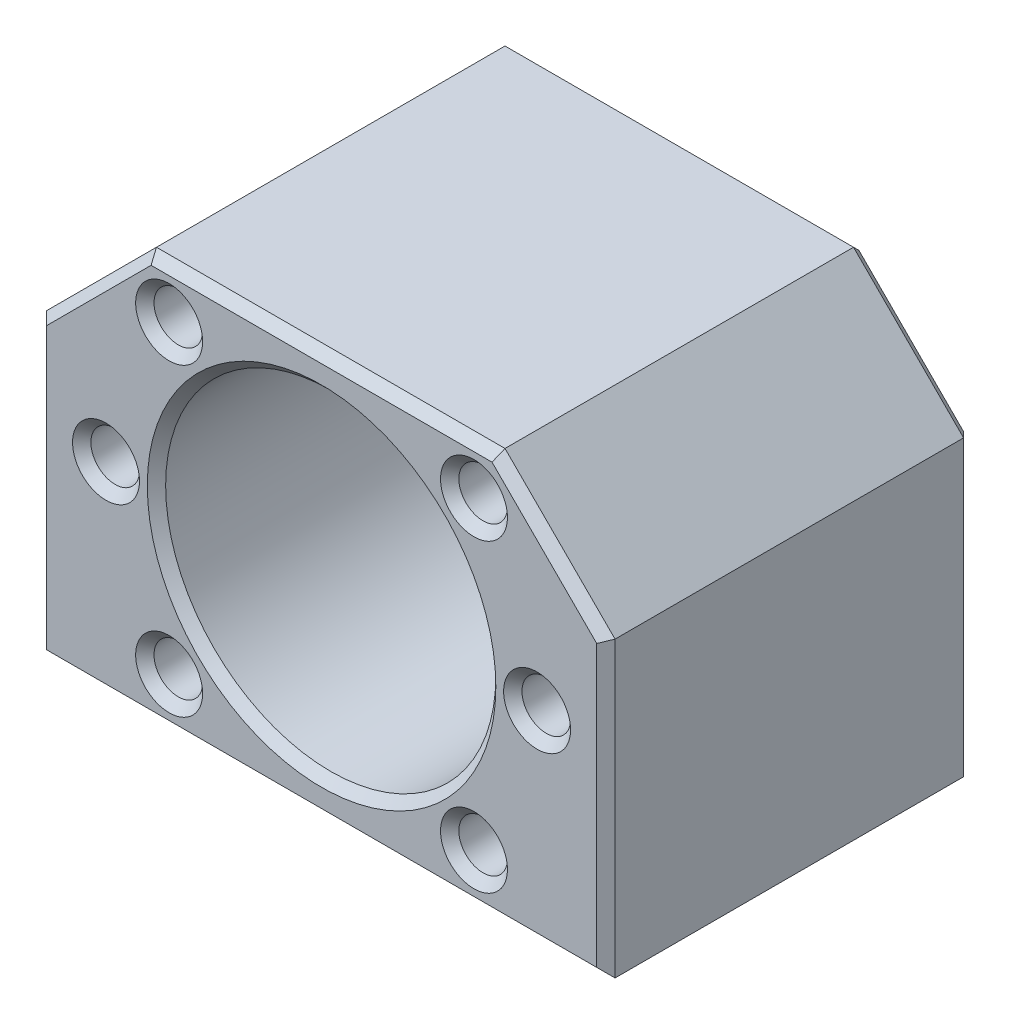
ISO-10303-21;
HEADER;
FILE_DESCRIPTION(('STEP AP214'),'2;1');
FILE_NAME('part.step','',(''),(''),'','','');
FILE_SCHEMA(('AUTOMOTIVE_DESIGN { 1 0 10303 214 1 1 1 1 }'));
ENDSEC;
DATA;
#1=APPLICATION_CONTEXT('core data for automotive mechanical design processes');
#2=APPLICATION_PROTOCOL_DEFINITION('international standard','automotive_design',2000,#1);
#3=PRODUCT_CONTEXT('',#1,'mechanical');
#4=PRODUCT('Part','Part','',(#3));
#5=PRODUCT_RELATED_PRODUCT_CATEGORY('part','',(#4));
#6=PRODUCT_DEFINITION_FORMATION('','',#4);
#7=PRODUCT_DEFINITION_CONTEXT('part definition',#1,'design');
#8=PRODUCT_DEFINITION('design','',#6,#7);
#9=PRODUCT_DEFINITION_SHAPE('','',#8);
#10=(LENGTH_UNIT() NAMED_UNIT(*) SI_UNIT(.MILLI.,.METRE.));
#11=(NAMED_UNIT(*) PLANE_ANGLE_UNIT() SI_UNIT($,.RADIAN.));
#12=(NAMED_UNIT(*) SI_UNIT($,.STERADIAN.) SOLID_ANGLE_UNIT());
#13=UNCERTAINTY_MEASURE_WITH_UNIT(LENGTH_MEASURE(1.E-05),#10,'distance_accuracy_value','');
#14=(GEOMETRIC_REPRESENTATION_CONTEXT(3) GLOBAL_UNCERTAINTY_ASSIGNED_CONTEXT((#13)) GLOBAL_UNIT_ASSIGNED_CONTEXT((#10,
#11,#12)) REPRESENTATION_CONTEXT('',''));
#15=CARTESIAN_POINT('',(0.,0.,0.));
#16=DIRECTION('',(0.,0.,1.));
#17=DIRECTION('',(1.,0.,0.));
#18=AXIS2_PLACEMENT_3D('',#15,#16,#17);
#19=CARTESIAN_POINT('',(0.,0.,20.));
#20=DIRECTION('',(0.,0.,1.));
#21=DIRECTION('',(1.,0.,0.));
#22=AXIS2_PLACEMENT_3D('',#19,#20,#21);
#23=PLANE('',#22);
#24=CARTESIAN_POINT('',(0.,0.,20.));
#25=DIRECTION('',(0.,0.,1.));
#26=DIRECTION('',(1.,0.,0.));
#27=AXIS2_PLACEMENT_3D('',#24,#25,#26);
#28=CIRCLE('',#27,19.);
#29=CARTESIAN_POINT('',(19.,0.,20.));
#30=VERTEX_POINT('',#29);
#31=EDGE_CURVE('E295',#30,#30,#28,.F.);
#32=ORIENTED_EDGE('',*,*,#31,.T.);
#33=EDGE_LOOP('',(#32));
#34=FACE_BOUND('',#33,.T.);
#35=DIRECTION('',(-0.707106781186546,-0.707106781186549,0.));
#36=VECTOR('',#35,1.);
#37=CARTESIAN_POINT('',(-19.7928932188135,19.7928932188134,20.));
#38=LINE('',#37,#36);
#39=CARTESIAN_POINT('',(-18.585786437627,21.,20.));
#40=VERTEX_POINT('',#39);
#41=CARTESIAN_POINT('',(-30.,9.58578643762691,20.));
#42=VERTEX_POINT('',#41);
#43=EDGE_CURVE('E81',#40,#42,#38,.T.);
#44=ORIENTED_EDGE('',*,*,#43,.T.);
#45=DIRECTION('',(0.,-1.,0.));
#46=VECTOR('',#45,1.);
#47=CARTESIAN_POINT('',(-30.,0.,20.));
#48=LINE('',#47,#46);
#49=CARTESIAN_POINT('',(-30.,-21.,20.));
#50=VERTEX_POINT('',#49);
#51=EDGE_CURVE('E292',#42,#50,#48,.T.);
#52=ORIENTED_EDGE('',*,*,#51,.T.);
#53=DIRECTION('',(1.,0.,0.));
#54=VECTOR('',#53,1.);
#55=CARTESIAN_POINT('',(31.,-21.,20.));
#56=LINE('',#55,#54);
#57=CARTESIAN_POINT('',(30.,-21.,20.));
#58=VERTEX_POINT('',#57);
#59=EDGE_CURVE('E279',#50,#58,#56,.T.);
#60=ORIENTED_EDGE('',*,*,#59,.T.);
#61=DIRECTION('',(0.,1.,0.));
#62=VECTOR('',#61,1.);
#63=CARTESIAN_POINT('',(30.,10.,20.));
#64=LINE('',#63,#62);
#65=CARTESIAN_POINT('',(30.,9.58578643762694,20.));
#66=VERTEX_POINT('',#65);
#67=EDGE_CURVE('E282',#58,#66,#64,.T.);
#68=ORIENTED_EDGE('',*,*,#67,.T.);
#69=DIRECTION('',(-0.707106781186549,0.707106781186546,0.));
#70=VECTOR('',#69,1.);
#71=CARTESIAN_POINT('',(19.7928932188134,19.7928932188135,20.));
#72=LINE('',#71,#70);
#73=CARTESIAN_POINT('',(18.5857864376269,21.,20.));
#74=VERTEX_POINT('',#73);
#75=EDGE_CURVE('E285',#66,#74,#72,.T.);
#76=ORIENTED_EDGE('',*,*,#75,.T.);
#77=DIRECTION('',(-1.,0.,0.));
#78=VECTOR('',#77,1.);
#79=CARTESIAN_POINT('',(0.,21.,20.));
#80=LINE('',#79,#78);
#81=EDGE_CURVE('E86',#74,#40,#80,.T.);
#82=ORIENTED_EDGE('',*,*,#81,.T.);
#83=EDGE_LOOP('',(#44,#52,#60,#68,#76,#82));
#84=FACE_BOUND('',#83,.T.);
#85=CARTESIAN_POINT('',(-16.6170093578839,16.6170093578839,20.));
#86=DIRECTION('',(0.,0.,1.));
#87=DIRECTION('',(1.,0.,0.));
#88=AXIS2_PLACEMENT_3D('',#85,#86,#87);
#89=CIRCLE('',#88,3.65000000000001);
#90=CARTESIAN_POINT('',(-12.9670093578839,16.6170093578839,20.));
#91=VERTEX_POINT('',#90);
#92=EDGE_CURVE('E275',#91,#91,#89,.F.);
#93=ORIENTED_EDGE('',*,*,#92,.T.);
#94=EDGE_LOOP('',(#93));
#95=FACE_BOUND('',#94,.T.);
#96=CARTESIAN_POINT('',(16.6170093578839,16.6170093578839,20.));
#97=DIRECTION('',(0.,0.,1.));
#98=DIRECTION('',(1.,0.,0.));
#99=AXIS2_PLACEMENT_3D('',#96,#97,#98);
#100=CIRCLE('',#99,3.65000000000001);
#101=CARTESIAN_POINT('',(20.2670093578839,16.6170093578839,20.));
#102=VERTEX_POINT('',#101);
#103=EDGE_CURVE('E271',#102,#102,#100,.F.);
#104=ORIENTED_EDGE('',*,*,#103,.T.);
#105=EDGE_LOOP('',(#104));
#106=FACE_BOUND('',#105,.T.);
#107=CARTESIAN_POINT('',(23.5,0.,20.));
#108=DIRECTION('',(0.,0.,1.));
#109=DIRECTION('',(1.,0.,0.));
#110=AXIS2_PLACEMENT_3D('',#107,#108,#109);
#111=CIRCLE('',#110,3.65000000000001);
#112=CARTESIAN_POINT('',(27.15,0.,20.));
#113=VERTEX_POINT('',#112);
#114=EDGE_CURVE('E267',#113,#113,#111,.F.);
#115=ORIENTED_EDGE('',*,*,#114,.T.);
#116=EDGE_LOOP('',(#115));
#117=FACE_BOUND('',#116,.T.);
#118=CARTESIAN_POINT('',(16.6170093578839,-16.6170093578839,20.));
#119=DIRECTION('',(0.,0.,1.));
#120=DIRECTION('',(1.,0.,0.));
#121=AXIS2_PLACEMENT_3D('',#118,#119,#120);
#122=CIRCLE('',#121,3.65);
#123=CARTESIAN_POINT('',(20.2670093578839,-16.6170093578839,20.));
#124=VERTEX_POINT('',#123);
#125=EDGE_CURVE('E263',#124,#124,#122,.F.);
#126=ORIENTED_EDGE('',*,*,#125,.T.);
#127=EDGE_LOOP('',(#126));
#128=FACE_BOUND('',#127,.T.);
#129=CARTESIAN_POINT('',(-16.6170093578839,-16.6170093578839,20.));
#130=DIRECTION('',(0.,0.,1.));
#131=DIRECTION('',(1.,0.,0.));
#132=AXIS2_PLACEMENT_3D('',#129,#130,#131);
#133=CIRCLE('',#132,3.65000000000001);
#134=CARTESIAN_POINT('',(-12.9670093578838,-16.6170093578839,20.));
#135=VERTEX_POINT('',#134);
#136=EDGE_CURVE('E259',#135,#135,#133,.F.);
#137=ORIENTED_EDGE('',*,*,#136,.T.);
#138=EDGE_LOOP('',(#137));
#139=FACE_BOUND('',#138,.T.);
#140=CARTESIAN_POINT('',(-23.5,0.,20.));
#141=DIRECTION('',(0.,0.,1.));
#142=DIRECTION('',(1.,0.,0.));
#143=AXIS2_PLACEMENT_3D('',#140,#141,#142);
#144=CIRCLE('',#143,3.65000000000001);
#145=CARTESIAN_POINT('',(-19.85,0.,20.));
#146=VERTEX_POINT('',#145);
#147=EDGE_CURVE('E255',#146,#146,#144,.F.);
#148=ORIENTED_EDGE('',*,*,#147,.T.);
#149=EDGE_LOOP('',(#148));
#150=FACE_BOUND('',#149,.T.);
#151=ADVANCED_FACE('F62',(#34,#84,#95,#106,#117,#128,#139,#150),#23,.T.);
#152=CARTESIAN_POINT('',(0.,0.,-20.));
#153=DIRECTION('',(0.,0.,1.));
#154=DIRECTION('',(1.,0.,0.));
#155=AXIS2_PLACEMENT_3D('',#152,#153,#154);
#156=PLANE('',#155);
#157=CARTESIAN_POINT('',(0.,0.,-20.));
#158=DIRECTION('',(0.,0.,1.));
#159=DIRECTION('',(1.,0.,0.));
#160=AXIS2_PLACEMENT_3D('',#157,#158,#159);
#161=CIRCLE('',#160,19.);
#162=CARTESIAN_POINT('',(19.,0.,-20.));
#163=VERTEX_POINT('',#162);
#164=EDGE_CURVE('E185',#163,#163,#161,.T.);
#165=ORIENTED_EDGE('',*,*,#164,.T.);
#166=EDGE_LOOP('',(#165));
#167=FACE_BOUND('',#166,.T.);
#168=DIRECTION('',(0.707106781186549,-0.707106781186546,0.));
#169=VECTOR('',#168,1.);
#170=CARTESIAN_POINT('',(30.2928932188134,9.29289321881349,-20.));
#171=LINE('',#170,#169);
#172=CARTESIAN_POINT('',(18.5857864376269,21.,-20.));
#173=VERTEX_POINT('',#172);
#174=CARTESIAN_POINT('',(30.,9.58578643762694,-20.));
#175=VERTEX_POINT('',#174);
#176=EDGE_CURVE('E183',#173,#175,#171,.T.);
#177=ORIENTED_EDGE('',*,*,#176,.T.);
#178=DIRECTION('',(0.,-1.,0.));
#179=VECTOR('',#178,1.);
#180=CARTESIAN_POINT('',(30.,0.,-20.));
#181=LINE('',#180,#179);
#182=CARTESIAN_POINT('',(30.,-21.,-20.));
#183=VERTEX_POINT('',#182);
#184=EDGE_CURVE('E160',#175,#183,#181,.T.);
#185=ORIENTED_EDGE('',*,*,#184,.T.);
#186=DIRECTION('',(-1.,0.,0.));
#187=VECTOR('',#186,1.);
#188=CARTESIAN_POINT('',(0.,-21.,-20.));
#189=LINE('',#188,#187);
#190=CARTESIAN_POINT('',(-30.,-21.,-20.));
#191=VERTEX_POINT('',#190);
#192=EDGE_CURVE('E171',#183,#191,#189,.T.);
#193=ORIENTED_EDGE('',*,*,#192,.T.);
#194=DIRECTION('',(0.,1.,0.));
#195=VECTOR('',#194,1.);
#196=CARTESIAN_POINT('',(-30.,10.,-20.));
#197=LINE('',#196,#195);
#198=CARTESIAN_POINT('',(-30.,9.58578643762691,-20.));
#199=VERTEX_POINT('',#198);
#200=EDGE_CURVE('E178',#191,#199,#197,.T.);
#201=ORIENTED_EDGE('',*,*,#200,.T.);
#202=DIRECTION('',(0.707106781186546,0.707106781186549,0.));
#203=VECTOR('',#202,1.);
#204=CARTESIAN_POINT('',(-18.2928932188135,21.2928932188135,-20.));
#205=LINE('',#204,#203);
#206=CARTESIAN_POINT('',(-18.5857864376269,21.,-20.));
#207=VERTEX_POINT('',#206);
#208=EDGE_CURVE('E430',#199,#207,#205,.T.);
#209=ORIENTED_EDGE('',*,*,#208,.T.);
#210=DIRECTION('',(1.,0.,0.));
#211=VECTOR('',#210,1.);
#212=CARTESIAN_POINT('',(19.,21.,-20.));
#213=LINE('',#212,#211);
#214=EDGE_CURVE('E192',#207,#173,#213,.T.);
#215=ORIENTED_EDGE('',*,*,#214,.T.);
#216=EDGE_LOOP('',(#177,#185,#193,#201,#209,#215));
#217=FACE_BOUND('',#216,.T.);
#218=ADVANCED_FACE('F181',(#167,#217),#156,.F.);
#219=CARTESIAN_POINT('',(-31.,-22.,20.));
#220=DIRECTION('',(0.,1.,0.));
#221=DIRECTION('',(0.,0.,1.));
#222=AXIS2_PLACEMENT_3D('',#219,#220,#221);
#223=PLANE('',#222);
#224=CARTESIAN_POINT('',(24.,-22.,12.));
#225=DIRECTION('',(0.,1.,0.));
#226=DIRECTION('',(0.,0.,1.));
#227=AXIS2_PLACEMENT_3D('',#224,#225,#226);
#228=CIRCLE('',#227,3.64999999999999);
#229=CARTESIAN_POINT('',(24.,-22.,15.65));
#230=VERTEX_POINT('',#229);
#231=EDGE_CURVE('E245',#230,#230,#228,.T.);
#232=ORIENTED_EDGE('',*,*,#231,.T.);
#233=EDGE_LOOP('',(#232));
#234=FACE_BOUND('',#233,.T.);
#235=CARTESIAN_POINT('',(24.,-22.,-12.));
#236=DIRECTION('',(0.,1.,0.));
#237=DIRECTION('',(0.,0.,1.));
#238=AXIS2_PLACEMENT_3D('',#235,#236,#237);
#239=CIRCLE('',#238,3.64999999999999);
#240=CARTESIAN_POINT('',(24.,-22.,-8.35000000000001));
#241=VERTEX_POINT('',#240);
#242=EDGE_CURVE('E241',#241,#241,#239,.T.);
#243=ORIENTED_EDGE('',*,*,#242,.T.);
#244=EDGE_LOOP('',(#243));
#245=FACE_BOUND('',#244,.T.);
#246=CARTESIAN_POINT('',(-24.,-22.,-12.));
#247=DIRECTION('',(0.,1.,0.));
#248=DIRECTION('',(0.,0.,1.));
#249=AXIS2_PLACEMENT_3D('',#246,#247,#248);
#250=CIRCLE('',#249,3.65000000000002);
#251=CARTESIAN_POINT('',(-24.,-22.,-8.34999999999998));
#252=VERTEX_POINT('',#251);
#253=EDGE_CURVE('E237',#252,#252,#250,.T.);
#254=ORIENTED_EDGE('',*,*,#253,.T.);
#255=EDGE_LOOP('',(#254));
#256=FACE_BOUND('',#255,.T.);
#257=CARTESIAN_POINT('',(-24.,-22.,12.));
#258=DIRECTION('',(0.,1.,0.));
#259=DIRECTION('',(0.,0.,1.));
#260=AXIS2_PLACEMENT_3D('',#257,#258,#259);
#261=CIRCLE('',#260,3.65000000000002);
#262=CARTESIAN_POINT('',(-24.,-22.,15.65));
#263=VERTEX_POINT('',#262);
#264=EDGE_CURVE('E233',#263,#263,#261,.T.);
#265=ORIENTED_EDGE('',*,*,#264,.T.);
#266=EDGE_LOOP('',(#265));
#267=FACE_BOUND('',#266,.T.);
#268=DIRECTION('',(0.,0.,-1.));
#269=VECTOR('',#268,1.);
#270=CARTESIAN_POINT('',(-31.,-22.,20.));
#271=LINE('',#270,#269);
#272=CARTESIAN_POINT('',(-31.,-22.,19.));
#273=VERTEX_POINT('',#272);
#274=CARTESIAN_POINT('',(-31.,-22.,-19.));
#275=VERTEX_POINT('',#274);
#276=EDGE_CURVE('E393',#273,#275,#271,.T.);
#277=ORIENTED_EDGE('',*,*,#276,.T.);
#278=DIRECTION('',(1.,0.,0.));
#279=VECTOR('',#278,1.);
#280=CARTESIAN_POINT('',(-31.,-22.,-19.));
#281=LINE('',#280,#279);
#282=CARTESIAN_POINT('',(31.,-22.,-19.));
#283=VERTEX_POINT('',#282);
#284=EDGE_CURVE('E252',#275,#283,#281,.T.);
#285=ORIENTED_EDGE('',*,*,#284,.T.);
#286=DIRECTION('',(0.,0.,-1.));
#287=VECTOR('',#286,1.);
#288=CARTESIAN_POINT('',(31.,-22.,20.));
#289=LINE('',#288,#287);
#290=CARTESIAN_POINT('',(31.,-22.,19.));
#291=VERTEX_POINT('',#290);
#292=EDGE_CURVE('E179',#291,#283,#289,.T.);
#293=ORIENTED_EDGE('',*,*,#292,.F.);
#294=DIRECTION('',(-1.,0.,0.));
#295=VECTOR('',#294,1.);
#296=CARTESIAN_POINT('',(-31.,-22.,19.));
#297=LINE('',#296,#295);
#298=EDGE_CURVE('E249',#291,#273,#297,.T.);
#299=ORIENTED_EDGE('',*,*,#298,.T.);
#300=EDGE_LOOP('',(#277,#285,#293,#299));
#301=FACE_BOUND('',#300,.T.);
#302=ADVANCED_FACE('F392',(#234,#245,#256,#267,#301),#223,.F.);
#303=CARTESIAN_POINT('',(31.,-22.,20.));
#304=DIRECTION('',(-1.,0.,0.));
#305=DIRECTION('',(0.,0.,1.));
#306=AXIS2_PLACEMENT_3D('',#303,#304,#305);
#307=PLANE('',#306);
#308=ORIENTED_EDGE('',*,*,#292,.T.);
#309=DIRECTION('',(0.,1.,0.));
#310=VECTOR('',#309,1.);
#311=CARTESIAN_POINT('',(31.,-22.,-19.));
#312=LINE('',#311,#310);
#313=CARTESIAN_POINT('',(31.,10.,-19.));
#314=VERTEX_POINT('',#313);
#315=EDGE_CURVE('E163',#283,#314,#312,.T.);
#316=ORIENTED_EDGE('',*,*,#315,.T.);
#317=DIRECTION('',(0.,0.,-1.));
#318=VECTOR('',#317,1.);
#319=CARTESIAN_POINT('',(31.,10.,20.));
#320=LINE('',#319,#318);
#321=CARTESIAN_POINT('',(31.,10.,19.));
#322=VERTEX_POINT('',#321);
#323=EDGE_CURVE('E422',#322,#314,#320,.T.);
#324=ORIENTED_EDGE('',*,*,#323,.F.);
#325=DIRECTION('',(0.,-1.,0.));
#326=VECTOR('',#325,1.);
#327=CARTESIAN_POINT('',(31.,-22.,19.));
#328=LINE('',#327,#326);
#329=EDGE_CURVE('E203',#322,#291,#328,.T.);
#330=ORIENTED_EDGE('',*,*,#329,.T.);
#331=EDGE_LOOP('',(#308,#316,#324,#330));
#332=FACE_BOUND('',#331,.T.);
#333=ADVANCED_FACE('F447',(#332),#307,.F.);
#334=CARTESIAN_POINT('',(19.,22.,20.));
#335=DIRECTION('',(0.707106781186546,0.707106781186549,0.));
#336=DIRECTION('',(-0.707106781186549,0.707106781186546,0.));
#337=AXIS2_PLACEMENT_3D('',#334,#335,#336);
#338=PLANE('',#337);
#339=ORIENTED_EDGE('',*,*,#323,.T.);
#340=DIRECTION('',(-0.707106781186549,0.707106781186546,0.));
#341=VECTOR('',#340,1.);
#342=CARTESIAN_POINT('',(19.,22.,-19.));
#343=LINE('',#342,#341);
#344=CARTESIAN_POINT('',(19.,22.,-19.));
#345=VERTEX_POINT('',#344);
#346=EDGE_CURVE('E211',#314,#345,#343,.T.);
#347=ORIENTED_EDGE('',*,*,#346,.T.);
#348=DIRECTION('',(0.,0.,-1.));
#349=VECTOR('',#348,1.);
#350=CARTESIAN_POINT('',(19.,22.,20.));
#351=LINE('',#350,#349);
#352=CARTESIAN_POINT('',(19.,22.,19.));
#353=VERTEX_POINT('',#352);
#354=EDGE_CURVE('E418',#353,#345,#351,.T.);
#355=ORIENTED_EDGE('',*,*,#354,.F.);
#356=DIRECTION('',(0.707106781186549,-0.707106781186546,0.));
#357=VECTOR('',#356,1.);
#358=CARTESIAN_POINT('',(19.,22.,19.));
#359=LINE('',#358,#357);
#360=EDGE_CURVE('E208',#353,#322,#359,.T.);
#361=ORIENTED_EDGE('',*,*,#360,.T.);
#362=EDGE_LOOP('',(#339,#347,#355,#361));
#363=FACE_BOUND('',#362,.T.);
#364=ADVANCED_FACE('F448',(#363),#338,.T.);
#365=CARTESIAN_POINT('',(-19.,22.,20.));
#366=DIRECTION('',(0.,1.,0.));
#367=DIRECTION('',(0.,0.,1.));
#368=AXIS2_PLACEMENT_3D('',#365,#366,#367);
#369=PLANE('',#368);
#370=ORIENTED_EDGE('',*,*,#354,.T.);
#371=DIRECTION('',(-1.,0.,0.));
#372=VECTOR('',#371,1.);
#373=CARTESIAN_POINT('',(-19.,22.,-19.));
#374=LINE('',#373,#372);
#375=CARTESIAN_POINT('',(-19.,22.,-19.));
#376=VERTEX_POINT('',#375);
#377=EDGE_CURVE('E217',#345,#376,#374,.T.);
#378=ORIENTED_EDGE('',*,*,#377,.T.);
#379=DIRECTION('',(0.,0.,-1.));
#380=VECTOR('',#379,1.);
#381=CARTESIAN_POINT('',(-19.,22.,20.));
#382=LINE('',#381,#380);
#383=CARTESIAN_POINT('',(-19.,22.,19.));
#384=VERTEX_POINT('',#383);
#385=EDGE_CURVE('E406',#384,#376,#382,.T.);
#386=ORIENTED_EDGE('',*,*,#385,.F.);
#387=DIRECTION('',(1.,0.,0.));
#388=VECTOR('',#387,1.);
#389=CARTESIAN_POINT('',(-19.,22.,19.));
#390=LINE('',#389,#388);
#391=EDGE_CURVE('E214',#384,#353,#390,.T.);
#392=ORIENTED_EDGE('',*,*,#391,.T.);
#393=EDGE_LOOP('',(#370,#378,#386,#392));
#394=FACE_BOUND('',#393,.T.);
#395=ADVANCED_FACE('F450',(#394),#369,.T.);
#396=CARTESIAN_POINT('',(-31.,10.,20.));
#397=DIRECTION('',(-0.707106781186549,0.707106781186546,0.));
#398=DIRECTION('',(-0.707106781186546,-0.707106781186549,0.));
#399=AXIS2_PLACEMENT_3D('',#396,#397,#398);
#400=PLANE('',#399);
#401=ORIENTED_EDGE('',*,*,#385,.T.);
#402=DIRECTION('',(-0.707106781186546,-0.707106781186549,0.));
#403=VECTOR('',#402,1.);
#404=CARTESIAN_POINT('',(-31.,10.,-19.));
#405=LINE('',#404,#403);
#406=CARTESIAN_POINT('',(-31.,10.,-19.));
#407=VERTEX_POINT('',#406);
#408=EDGE_CURVE('E223',#376,#407,#405,.T.);
#409=ORIENTED_EDGE('',*,*,#408,.T.);
#410=DIRECTION('',(0.,0.,-1.));
#411=VECTOR('',#410,1.);
#412=CARTESIAN_POINT('',(-31.,10.,20.));
#413=LINE('',#412,#411);
#414=CARTESIAN_POINT('',(-31.,10.,19.));
#415=VERTEX_POINT('',#414);
#416=EDGE_CURVE('E401',#415,#407,#413,.T.);
#417=ORIENTED_EDGE('',*,*,#416,.F.);
#418=DIRECTION('',(0.707106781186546,0.707106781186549,0.));
#419=VECTOR('',#418,1.);
#420=CARTESIAN_POINT('',(-31.,10.,19.));
#421=LINE('',#420,#419);
#422=EDGE_CURVE('E220',#415,#384,#421,.T.);
#423=ORIENTED_EDGE('',*,*,#422,.T.);
#424=EDGE_LOOP('',(#401,#409,#417,#423));
#425=FACE_BOUND('',#424,.T.);
#426=ADVANCED_FACE('F486',(#425),#400,.T.);
#427=CARTESIAN_POINT('',(-31.,-22.,20.));
#428=DIRECTION('',(-1.,0.,0.));
#429=DIRECTION('',(0.,0.,1.));
#430=AXIS2_PLACEMENT_3D('',#427,#428,#429);
#431=PLANE('',#430);
#432=ORIENTED_EDGE('',*,*,#416,.T.);
#433=DIRECTION('',(0.,-1.,0.));
#434=VECTOR('',#433,1.);
#435=CARTESIAN_POINT('',(-31.,-22.,-19.));
#436=LINE('',#435,#434);
#437=EDGE_CURVE('E230',#407,#275,#436,.T.);
#438=ORIENTED_EDGE('',*,*,#437,.T.);
#439=ORIENTED_EDGE('',*,*,#276,.F.);
#440=DIRECTION('',(0.,1.,0.));
#441=VECTOR('',#440,1.);
#442=CARTESIAN_POINT('',(-31.,-22.,19.));
#443=LINE('',#442,#441);
#444=EDGE_CURVE('E226',#273,#415,#443,.T.);
#445=ORIENTED_EDGE('',*,*,#444,.T.);
#446=EDGE_LOOP('',(#432,#438,#439,#445));
#447=FACE_BOUND('',#446,.T.);
#448=ADVANCED_FACE('F397',(#447),#431,.T.);
#449=CARTESIAN_POINT('',(0.,0.,20.));
#450=DIRECTION('',(0.,0.,-1.));
#451=DIRECTION('',(-1.,0.,0.));
#452=AXIS2_PLACEMENT_3D('',#449,#450,#451);
#453=CYLINDRICAL_SURFACE('',#452,18.);
#454=CARTESIAN_POINT('',(0.,0.,-19.));
#455=DIRECTION('',(0.,0.,1.));
#456=DIRECTION('',(1.,0.,0.));
#457=AXIS2_PLACEMENT_3D('',#454,#455,#456);
#458=CIRCLE('',#457,18.);
#459=CARTESIAN_POINT('',(18.,0.,-19.));
#460=VERTEX_POINT('',#459);
#461=EDGE_CURVE('E199',#460,#460,#458,.F.);
#462=ORIENTED_EDGE('',*,*,#461,.T.);
#463=EDGE_LOOP('',(#462));
#464=FACE_BOUND('',#463,.T.);
#465=CARTESIAN_POINT('',(0.,0.,19.));
#466=DIRECTION('',(0.,0.,1.));
#467=DIRECTION('',(1.,0.,0.));
#468=AXIS2_PLACEMENT_3D('',#465,#466,#467);
#469=CIRCLE('',#468,18.);
#470=CARTESIAN_POINT('',(18.,0.,19.));
#471=VERTEX_POINT('',#470);
#472=EDGE_CURVE('E190',#471,#471,#469,.T.);
#473=ORIENTED_EDGE('',*,*,#472,.T.);
#474=EDGE_LOOP('',(#473));
#475=FACE_BOUND('',#474,.T.);
#476=ADVANCED_FACE('F481',(#464,#475),#453,.F.);
#477=CARTESIAN_POINT('',(-16.6170093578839,16.6170093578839,5.));
#478=DIRECTION('',(0.,0.,1.));
#479=DIRECTION('',(1.,0.,0.));
#480=AXIS2_PLACEMENT_3D('',#477,#478,#479);
#481=CYLINDRICAL_SURFACE('',#480,2.65);
#482=CARTESIAN_POINT('',(-16.6170093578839,16.6170093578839,19.));
#483=DIRECTION('',(0.,0.,1.));
#484=DIRECTION('',(1.,0.,0.));
#485=AXIS2_PLACEMENT_3D('',#482,#483,#484);
#486=CIRCLE('',#485,2.65);
#487=CARTESIAN_POINT('',(-13.9670093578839,16.6170093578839,19.));
#488=VERTEX_POINT('',#487);
#489=EDGE_CURVE('E299',#488,#488,#486,.T.);
#490=ORIENTED_EDGE('',*,*,#489,.T.);
#491=EDGE_LOOP('',(#490));
#492=FACE_BOUND('',#491,.T.);
#493=CARTESIAN_POINT('',(-16.6170093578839,16.6170093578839,5.));
#494=DIRECTION('',(0.,0.,1.));
#495=DIRECTION('',(1.,0.,0.));
#496=AXIS2_PLACEMENT_3D('',#493,#494,#495);
#497=CIRCLE('',#496,2.65);
#498=CARTESIAN_POINT('',(-13.9670093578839,16.6170093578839,5.));
#499=VERTEX_POINT('',#498);
#500=EDGE_CURVE('E409',#499,#499,#497,.T.);
#501=ORIENTED_EDGE('',*,*,#500,.F.);
#502=EDGE_LOOP('',(#501));
#503=FACE_BOUND('',#502,.T.);
#504=ADVANCED_FACE('F556',(#492,#503),#481,.F.);
#505=CARTESIAN_POINT('',(-16.6170093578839,16.6170093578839,5.));
#506=DIRECTION('',(0.,0.,1.));
#507=DIRECTION('',(1.,0.,0.));
#508=AXIS2_PLACEMENT_3D('',#505,#506,#507);
#509=PLANE('',#508);
#510=ORIENTED_EDGE('',*,*,#500,.T.);
#511=EDGE_LOOP('',(#510));
#512=FACE_BOUND('',#511,.T.);
#513=ADVANCED_FACE('F561',(#512),#509,.T.);
#514=CARTESIAN_POINT('',(16.6170093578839,16.6170093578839,5.));
#515=DIRECTION('',(0.,0.,1.));
#516=DIRECTION('',(1.,0.,0.));
#517=AXIS2_PLACEMENT_3D('',#514,#515,#516);
#518=CYLINDRICAL_SURFACE('',#517,2.65);
#519=CARTESIAN_POINT('',(16.6170093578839,16.6170093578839,19.));
#520=DIRECTION('',(0.,0.,1.));
#521=DIRECTION('',(1.,0.,0.));
#522=AXIS2_PLACEMENT_3D('',#519,#520,#521);
#523=CIRCLE('',#522,2.65);
#524=CARTESIAN_POINT('',(19.2670093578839,16.6170093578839,19.));
#525=VERTEX_POINT('',#524);
#526=EDGE_CURVE('E303',#525,#525,#523,.T.);
#527=ORIENTED_EDGE('',*,*,#526,.T.);
#528=EDGE_LOOP('',(#527));
#529=FACE_BOUND('',#528,.T.);
#530=CARTESIAN_POINT('',(16.6170093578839,16.6170093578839,5.));
#531=DIRECTION('',(0.,0.,1.));
#532=DIRECTION('',(1.,0.,0.));
#533=AXIS2_PLACEMENT_3D('',#530,#531,#532);
#534=CIRCLE('',#533,2.65);
#535=CARTESIAN_POINT('',(19.2670093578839,16.6170093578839,5.));
#536=VERTEX_POINT('',#535);
#537=EDGE_CURVE('E613',#536,#536,#534,.T.);
#538=ORIENTED_EDGE('',*,*,#537,.F.);
#539=EDGE_LOOP('',(#538));
#540=FACE_BOUND('',#539,.T.);
#541=ADVANCED_FACE('F570',(#529,#540),#518,.F.);
#542=CARTESIAN_POINT('',(16.6170093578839,16.6170093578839,5.));
#543=DIRECTION('',(0.,0.,1.));
#544=DIRECTION('',(1.,0.,0.));
#545=AXIS2_PLACEMENT_3D('',#542,#543,#544);
#546=PLANE('',#545);
#547=ORIENTED_EDGE('',*,*,#537,.T.);
#548=EDGE_LOOP('',(#547));
#549=FACE_BOUND('',#548,.T.);
#550=ADVANCED_FACE('F580',(#549),#546,.T.);
#551=CARTESIAN_POINT('',(23.5,0.,5.));
#552=DIRECTION('',(0.,0.,1.));
#553=DIRECTION('',(1.,0.,0.));
#554=AXIS2_PLACEMENT_3D('',#551,#552,#553);
#555=CYLINDRICAL_SURFACE('',#554,2.65);
#556=CARTESIAN_POINT('',(23.5,0.,19.));
#557=DIRECTION('',(0.,0.,1.));
#558=DIRECTION('',(1.,0.,0.));
#559=AXIS2_PLACEMENT_3D('',#556,#557,#558);
#560=CIRCLE('',#559,2.65);
#561=CARTESIAN_POINT('',(26.15,0.,19.));
#562=VERTEX_POINT('',#561);
#563=EDGE_CURVE('E307',#562,#562,#560,.T.);
#564=ORIENTED_EDGE('',*,*,#563,.T.);
#565=EDGE_LOOP('',(#564));
#566=FACE_BOUND('',#565,.T.);
#567=CARTESIAN_POINT('',(23.5,0.,5.));
#568=DIRECTION('',(0.,0.,1.));
#569=DIRECTION('',(1.,0.,0.));
#570=AXIS2_PLACEMENT_3D('',#567,#568,#569);
#571=CIRCLE('',#570,2.65);
#572=CARTESIAN_POINT('',(26.15,0.,5.));
#573=VERTEX_POINT('',#572);
#574=EDGE_CURVE('E608',#573,#573,#571,.T.);
#575=ORIENTED_EDGE('',*,*,#574,.F.);
#576=EDGE_LOOP('',(#575));
#577=FACE_BOUND('',#576,.T.);
#578=ADVANCED_FACE('F584',(#566,#577),#555,.F.);
#579=CARTESIAN_POINT('',(23.5,0.,5.));
#580=DIRECTION('',(0.,0.,1.));
#581=DIRECTION('',(1.,0.,0.));
#582=AXIS2_PLACEMENT_3D('',#579,#580,#581);
#583=PLANE('',#582);
#584=ORIENTED_EDGE('',*,*,#574,.T.);
#585=EDGE_LOOP('',(#584));
#586=FACE_BOUND('',#585,.T.);
#587=ADVANCED_FACE('F588',(#586),#583,.T.);
#588=CARTESIAN_POINT('',(16.6170093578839,-16.6170093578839,5.));
#589=DIRECTION('',(0.,0.,1.));
#590=DIRECTION('',(1.,0.,0.));
#591=AXIS2_PLACEMENT_3D('',#588,#589,#590);
#592=CYLINDRICAL_SURFACE('',#591,2.65);
#593=CARTESIAN_POINT('',(16.6170093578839,-16.6170093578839,19.));
#594=DIRECTION('',(0.,0.,1.));
#595=DIRECTION('',(1.,0.,0.));
#596=AXIS2_PLACEMENT_3D('',#593,#594,#595);
#597=CIRCLE('',#596,2.65);
#598=CARTESIAN_POINT('',(19.2670093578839,-16.6170093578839,19.));
#599=VERTEX_POINT('',#598);
#600=EDGE_CURVE('E311',#599,#599,#597,.T.);
#601=ORIENTED_EDGE('',*,*,#600,.T.);
#602=EDGE_LOOP('',(#601));
#603=FACE_BOUND('',#602,.T.);
#604=CARTESIAN_POINT('',(16.6170093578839,-16.6170093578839,5.));
#605=DIRECTION('',(0.,0.,1.));
#606=DIRECTION('',(1.,0.,0.));
#607=AXIS2_PLACEMENT_3D('',#604,#605,#606);
#608=CIRCLE('',#607,2.65);
#609=CARTESIAN_POINT('',(19.2670093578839,-16.6170093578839,5.));
#610=VERTEX_POINT('',#609);
#611=EDGE_CURVE('E412',#610,#610,#608,.T.);
#612=ORIENTED_EDGE('',*,*,#611,.F.);
#613=EDGE_LOOP('',(#612));
#614=FACE_BOUND('',#613,.T.);
#615=ADVANCED_FACE('F592',(#603,#614),#592,.F.);
#616=CARTESIAN_POINT('',(16.6170093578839,-16.6170093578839,5.));
#617=DIRECTION('',(0.,0.,1.));
#618=DIRECTION('',(1.,0.,0.));
#619=AXIS2_PLACEMENT_3D('',#616,#617,#618);
#620=PLANE('',#619);
#621=ORIENTED_EDGE('',*,*,#611,.T.);
#622=EDGE_LOOP('',(#621));
#623=FACE_BOUND('',#622,.T.);
#624=ADVANCED_FACE('F595',(#623),#620,.T.);
#625=CARTESIAN_POINT('',(-16.6170093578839,-16.6170093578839,5.));
#626=DIRECTION('',(0.,0.,1.));
#627=DIRECTION('',(1.,0.,0.));
#628=AXIS2_PLACEMENT_3D('',#625,#626,#627);
#629=CYLINDRICAL_SURFACE('',#628,2.65);
#630=CARTESIAN_POINT('',(-16.6170093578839,-16.6170093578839,19.));
#631=DIRECTION('',(0.,0.,1.));
#632=DIRECTION('',(1.,0.,0.));
#633=AXIS2_PLACEMENT_3D('',#630,#631,#632);
#634=CIRCLE('',#633,2.65);
#635=CARTESIAN_POINT('',(-13.9670093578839,-16.6170093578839,19.));
#636=VERTEX_POINT('',#635);
#637=EDGE_CURVE('E315',#636,#636,#634,.T.);
#638=ORIENTED_EDGE('',*,*,#637,.T.);
#639=EDGE_LOOP('',(#638));
#640=FACE_BOUND('',#639,.T.);
#641=CARTESIAN_POINT('',(-16.6170093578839,-16.6170093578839,5.));
#642=DIRECTION('',(0.,0.,1.));
#643=DIRECTION('',(1.,0.,0.));
#644=AXIS2_PLACEMENT_3D('',#641,#642,#643);
#645=CIRCLE('',#644,2.65);
#646=CARTESIAN_POINT('',(-13.9670093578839,-16.6170093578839,5.));
#647=VERTEX_POINT('',#646);
#648=EDGE_CURVE('E609',#647,#647,#645,.T.);
#649=ORIENTED_EDGE('',*,*,#648,.F.);
#650=EDGE_LOOP('',(#649));
#651=FACE_BOUND('',#650,.T.);
#652=ADVANCED_FACE('F598',(#640,#651),#629,.F.);
#653=CARTESIAN_POINT('',(-16.6170093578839,-16.6170093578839,5.));
#654=DIRECTION('',(0.,0.,1.));
#655=DIRECTION('',(1.,0.,0.));
#656=AXIS2_PLACEMENT_3D('',#653,#654,#655);
#657=PLANE('',#656);
#658=ORIENTED_EDGE('',*,*,#648,.T.);
#659=EDGE_LOOP('',(#658));
#660=FACE_BOUND('',#659,.T.);
#661=ADVANCED_FACE('F575',(#660),#657,.T.);
#662=CARTESIAN_POINT('',(-23.5,0.,5.));
#663=DIRECTION('',(0.,0.,1.));
#664=DIRECTION('',(1.,0.,0.));
#665=AXIS2_PLACEMENT_3D('',#662,#663,#664);
#666=CYLINDRICAL_SURFACE('',#665,2.65);
#667=CARTESIAN_POINT('',(-23.5,0.,19.));
#668=DIRECTION('',(0.,0.,1.));
#669=DIRECTION('',(1.,0.,0.));
#670=AXIS2_PLACEMENT_3D('',#667,#668,#669);
#671=CIRCLE('',#670,2.65);
#672=CARTESIAN_POINT('',(-20.85,0.,19.));
#673=VERTEX_POINT('',#672);
#674=EDGE_CURVE('E319',#673,#673,#671,.T.);
#675=ORIENTED_EDGE('',*,*,#674,.T.);
#676=EDGE_LOOP('',(#675));
#677=FACE_BOUND('',#676,.T.);
#678=CARTESIAN_POINT('',(-23.5,0.,5.));
#679=DIRECTION('',(0.,0.,1.));
#680=DIRECTION('',(1.,0.,0.));
#681=AXIS2_PLACEMENT_3D('',#678,#679,#680);
#682=CIRCLE('',#681,2.65);
#683=CARTESIAN_POINT('',(-20.85,0.,5.));
#684=VERTEX_POINT('',#683);
#685=EDGE_CURVE('E402',#684,#684,#682,.T.);
#686=ORIENTED_EDGE('',*,*,#685,.F.);
#687=EDGE_LOOP('',(#686));
#688=FACE_BOUND('',#687,.T.);
#689=ADVANCED_FACE('F681',(#677,#688),#666,.F.);
#690=CARTESIAN_POINT('',(-23.5,0.,5.));
#691=DIRECTION('',(0.,0.,1.));
#692=DIRECTION('',(1.,0.,0.));
#693=AXIS2_PLACEMENT_3D('',#690,#691,#692);
#694=PLANE('',#693);
#695=ORIENTED_EDGE('',*,*,#685,.T.);
#696=EDGE_LOOP('',(#695));
#697=FACE_BOUND('',#696,.T.);
#698=ADVANCED_FACE('F677',(#697),#694,.T.);
#699=CARTESIAN_POINT('',(-24.,-7.,12.));
#700=DIRECTION('',(0.,-1.,0.));
#701=DIRECTION('',(0.,0.,-1.));
#702=AXIS2_PLACEMENT_3D('',#699,#700,#701);
#703=CYLINDRICAL_SURFACE('',#702,2.65);
#704=CARTESIAN_POINT('',(-24.,-21.,12.));
#705=DIRECTION('',(0.,1.,0.));
#706=DIRECTION('',(0.,0.,1.));
#707=AXIS2_PLACEMENT_3D('',#704,#705,#706);
#708=CIRCLE('',#707,2.65);
#709=CARTESIAN_POINT('',(-24.,-21.,14.65));
#710=VERTEX_POINT('',#709);
#711=EDGE_CURVE('E12',#710,#710,#708,.F.);
#712=ORIENTED_EDGE('',*,*,#711,.T.);
#713=EDGE_LOOP('',(#712));
#714=FACE_BOUND('',#713,.T.);
#715=CARTESIAN_POINT('',(-24.,-7.,12.));
#716=DIRECTION('',(0.,-1.,0.));
#717=DIRECTION('',(0.,0.,-1.));
#718=AXIS2_PLACEMENT_3D('',#715,#716,#717);
#719=CIRCLE('',#718,2.65);
#720=CARTESIAN_POINT('',(-24.,-7.,9.35));
#721=VERTEX_POINT('',#720);
#722=EDGE_CURVE('E615',#721,#721,#719,.T.);
#723=ORIENTED_EDGE('',*,*,#722,.F.);
#724=EDGE_LOOP('',(#723));
#725=FACE_BOUND('',#724,.T.);
#726=ADVANCED_FACE('F657',(#714,#725),#703,.F.);
#727=CARTESIAN_POINT('',(-24.,-7.,12.));
#728=DIRECTION('',(0.,-1.,0.));
#729=DIRECTION('',(0.,0.,-1.));
#730=AXIS2_PLACEMENT_3D('',#727,#728,#729);
#731=PLANE('',#730);
#732=ORIENTED_EDGE('',*,*,#722,.T.);
#733=EDGE_LOOP('',(#732));
#734=FACE_BOUND('',#733,.T.);
#735=ADVANCED_FACE('F648',(#734),#731,.T.);
#736=CARTESIAN_POINT('',(24.,-7.,12.));
#737=DIRECTION('',(0.,-1.,0.));
#738=DIRECTION('',(0.,0.,-1.));
#739=AXIS2_PLACEMENT_3D('',#736,#737,#738);
#740=CYLINDRICAL_SURFACE('',#739,2.65);
#741=CARTESIAN_POINT('',(24.,-21.,12.));
#742=DIRECTION('',(0.,1.,0.));
#743=DIRECTION('',(0.,0.,1.));
#744=AXIS2_PLACEMENT_3D('',#741,#742,#743);
#745=CIRCLE('',#744,2.65);
#746=CARTESIAN_POINT('',(24.,-21.,14.65));
#747=VERTEX_POINT('',#746);
#748=EDGE_CURVE('E323',#747,#747,#745,.F.);
#749=ORIENTED_EDGE('',*,*,#748,.T.);
#750=EDGE_LOOP('',(#749));
#751=FACE_BOUND('',#750,.T.);
#752=CARTESIAN_POINT('',(24.,-7.,12.));
#753=DIRECTION('',(0.,-1.,0.));
#754=DIRECTION('',(0.,0.,1.));
#755=AXIS2_PLACEMENT_3D('',#752,#753,#754);
#756=CIRCLE('',#755,2.65);
#757=CARTESIAN_POINT('',(24.,-7.,14.65));
#758=VERTEX_POINT('',#757);
#759=EDGE_CURVE('E621',#758,#758,#756,.T.);
#760=ORIENTED_EDGE('',*,*,#759,.F.);
#761=EDGE_LOOP('',(#760));
#762=FACE_BOUND('',#761,.T.);
#763=ADVANCED_FACE('F646',(#751,#762),#740,.F.);
#764=CARTESIAN_POINT('',(24.,-7.,12.));
#765=DIRECTION('',(0.,1.,0.));
#766=DIRECTION('',(0.,0.,1.));
#767=AXIS2_PLACEMENT_3D('',#764,#765,#766);
#768=PLANE('',#767);
#769=ORIENTED_EDGE('',*,*,#759,.T.);
#770=EDGE_LOOP('',(#769));
#771=FACE_BOUND('',#770,.T.);
#772=ADVANCED_FACE('F644',(#771),#768,.F.);
#773=CARTESIAN_POINT('',(24.,-7.,-12.));
#774=DIRECTION('',(0.,-1.,0.));
#775=DIRECTION('',(0.,0.,-1.));
#776=AXIS2_PLACEMENT_3D('',#773,#774,#775);
#777=CYLINDRICAL_SURFACE('',#776,2.65);
#778=CARTESIAN_POINT('',(24.,-21.,-12.));
#779=DIRECTION('',(0.,1.,0.));
#780=DIRECTION('',(0.,0.,1.));
#781=AXIS2_PLACEMENT_3D('',#778,#779,#780);
#782=CIRCLE('',#781,2.65);
#783=CARTESIAN_POINT('',(24.,-21.,-9.35));
#784=VERTEX_POINT('',#783);
#785=EDGE_CURVE('E327',#784,#784,#782,.F.);
#786=ORIENTED_EDGE('',*,*,#785,.T.);
#787=EDGE_LOOP('',(#786));
#788=FACE_BOUND('',#787,.T.);
#789=CARTESIAN_POINT('',(24.,-7.,-12.));
#790=DIRECTION('',(0.,-1.,0.));
#791=DIRECTION('',(0.,0.,-1.));
#792=AXIS2_PLACEMENT_3D('',#789,#790,#791);
#793=CIRCLE('',#792,2.65);
#794=CARTESIAN_POINT('',(24.,-7.,-14.65));
#795=VERTEX_POINT('',#794);
#796=EDGE_CURVE('E636',#795,#795,#793,.T.);
#797=ORIENTED_EDGE('',*,*,#796,.F.);
#798=EDGE_LOOP('',(#797));
#799=FACE_BOUND('',#798,.T.);
#800=ADVANCED_FACE('F655',(#788,#799),#777,.F.);
#801=CARTESIAN_POINT('',(24.,-7.,-12.));
#802=DIRECTION('',(0.,-1.,0.));
#803=DIRECTION('',(0.,0.,-1.));
#804=AXIS2_PLACEMENT_3D('',#801,#802,#803);
#805=PLANE('',#804);
#806=ORIENTED_EDGE('',*,*,#796,.T.);
#807=EDGE_LOOP('',(#806));
#808=FACE_BOUND('',#807,.T.);
#809=ADVANCED_FACE('F661',(#808),#805,.T.);
#810=CARTESIAN_POINT('',(-24.,-7.,-12.));
#811=DIRECTION('',(0.,-1.,0.));
#812=DIRECTION('',(0.,0.,-1.));
#813=AXIS2_PLACEMENT_3D('',#810,#811,#812);
#814=CYLINDRICAL_SURFACE('',#813,2.65);
#815=CARTESIAN_POINT('',(-24.,-21.,-12.));
#816=DIRECTION('',(0.,1.,0.));
#817=DIRECTION('',(0.,0.,1.));
#818=AXIS2_PLACEMENT_3D('',#815,#816,#817);
#819=CIRCLE('',#818,2.65);
#820=CARTESIAN_POINT('',(-24.,-21.,-9.35));
#821=VERTEX_POINT('',#820);
#822=EDGE_CURVE('E73',#821,#821,#819,.F.);
#823=ORIENTED_EDGE('',*,*,#822,.T.);
#824=EDGE_LOOP('',(#823));
#825=FACE_BOUND('',#824,.T.);
#826=CARTESIAN_POINT('',(-24.,-7.,-12.));
#827=DIRECTION('',(0.,-1.,0.));
#828=DIRECTION('',(0.,0.,1.));
#829=AXIS2_PLACEMENT_3D('',#826,#827,#828);
#830=CIRCLE('',#829,2.65);
#831=CARTESIAN_POINT('',(-24.,-7.,-9.35));
#832=VERTEX_POINT('',#831);
#833=EDGE_CURVE('E349',#832,#832,#830,.T.);
#834=ORIENTED_EDGE('',*,*,#833,.F.);
#835=EDGE_LOOP('',(#834));
#836=FACE_BOUND('',#835,.T.);
#837=ADVANCED_FACE('F664',(#825,#836),#814,.F.);
#838=CARTESIAN_POINT('',(-24.,-7.,-12.));
#839=DIRECTION('',(0.,1.,0.));
#840=DIRECTION('',(0.,0.,1.));
#841=AXIS2_PLACEMENT_3D('',#838,#839,#840);
#842=PLANE('',#841);
#843=ORIENTED_EDGE('',*,*,#833,.T.);
#844=EDGE_LOOP('',(#843));
#845=FACE_BOUND('',#844,.T.);
#846=ADVANCED_FACE('F507',(#845),#842,.F.);
#847=CARTESIAN_POINT('',(0.,0.,-20.));
#848=DIRECTION('',(0.,0.,-1.));
#849=DIRECTION('',(-1.,0.,0.));
#850=AXIS2_PLACEMENT_3D('',#847,#848,#849);
#851=CONICAL_SURFACE('',#850,19.,0.785398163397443);
#852=ORIENTED_EDGE('',*,*,#461,.F.);
#853=EDGE_LOOP('',(#852));
#854=FACE_BOUND('',#853,.T.);
#855=ORIENTED_EDGE('',*,*,#164,.F.);
#856=EDGE_LOOP('',(#855));
#857=FACE_BOUND('',#856,.T.);
#858=ADVANCED_FACE('F500',(#854,#857),#851,.F.);
#859=CARTESIAN_POINT('',(-19.7928932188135,19.7928932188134,-20.));
#860=DIRECTION('',(-0.500000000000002,0.5,-0.707106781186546));
#861=DIRECTION('',(-0.707106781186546,-0.707106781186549,0.));
#862=AXIS2_PLACEMENT_3D('',#859,#860,#861);
#863=PLANE('',#862);
#864=DIRECTION('',(0.281084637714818,-0.678598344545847,-0.678598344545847));
#865=VECTOR('',#864,1.);
#866=CARTESIAN_POINT('',(-18.450910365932,20.6743803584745,-20.3256196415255));
#867=LINE('',#866,#865);
#868=EDGE_CURVE('E341',#207,#376,#867,.F.);
#869=ORIENTED_EDGE('',*,*,#868,.F.);
#870=ORIENTED_EDGE('',*,*,#208,.F.);
#871=DIRECTION('',(0.678598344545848,-0.281084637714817,-0.678598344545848));
#872=VECTOR('',#871,1.);
#873=CARTESIAN_POINT('',(-28.1715728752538,8.82842712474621,-21.8284271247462));
#874=LINE('',#873,#872);
#875=EDGE_CURVE('E345',#407,#199,#874,.T.);
#876=ORIENTED_EDGE('',*,*,#875,.F.);
#877=ORIENTED_EDGE('',*,*,#408,.F.);
#878=EDGE_LOOP('',(#869,#870,#876,#877));
#879=FACE_BOUND('',#878,.T.);
#880=ADVANCED_FACE('F506',(#879),#863,.T.);
#881=CARTESIAN_POINT('',(-30.,0.,-20.));
#882=DIRECTION('',(-0.707106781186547,0.,-0.707106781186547));
#883=DIRECTION('',(0.,-1.,0.));
#884=AXIS2_PLACEMENT_3D('',#881,#882,#883);
#885=PLANE('',#884);
#886=ORIENTED_EDGE('',*,*,#875,.T.);
#887=ORIENTED_EDGE('',*,*,#200,.F.);
#888=DIRECTION('',(-0.577350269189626,-0.577350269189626,0.577350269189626));
#889=VECTOR('',#888,1.);
#890=CARTESIAN_POINT('',(-31.,-22.,-19.));
#891=LINE('',#890,#889);
#892=EDGE_CURVE('E174',#275,#191,#891,.F.);
#893=ORIENTED_EDGE('',*,*,#892,.F.);
#894=ORIENTED_EDGE('',*,*,#437,.F.);
#895=EDGE_LOOP('',(#886,#887,#893,#894));
#896=FACE_BOUND('',#895,.T.);
#897=ADVANCED_FACE('F532',(#896),#885,.T.);
#898=CARTESIAN_POINT('',(0.,21.,-20.));
#899=DIRECTION('',(0.,0.707106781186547,-0.707106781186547));
#900=DIRECTION('',(-1.,0.,0.));
#901=AXIS2_PLACEMENT_3D('',#898,#899,#900);
#902=PLANE('',#901);
#903=ORIENTED_EDGE('',*,*,#868,.T.);
#904=ORIENTED_EDGE('',*,*,#377,.F.);
#905=DIRECTION('',(-0.281084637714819,-0.678598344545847,-0.678598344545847));
#906=VECTOR('',#905,1.);
#907=CARTESIAN_POINT('',(17.1173499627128,17.4548807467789,-23.5451192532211));
#908=LINE('',#907,#906);
#909=EDGE_CURVE('E167',#173,#345,#908,.F.);
#910=ORIENTED_EDGE('',*,*,#909,.F.);
#911=ORIENTED_EDGE('',*,*,#214,.F.);
#912=EDGE_LOOP('',(#903,#904,#910,#911));
#913=FACE_BOUND('',#912,.T.);
#914=ADVANCED_FACE('F439',(#913),#902,.T.);
#915=CARTESIAN_POINT('',(-31.,-22.,-19.));
#916=DIRECTION('',(0.,0.707106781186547,0.707106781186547));
#917=DIRECTION('',(1.,0.,0.));
#918=AXIS2_PLACEMENT_3D('',#915,#916,#917);
#919=PLANE('',#918);
#920=ORIENTED_EDGE('',*,*,#892,.T.);
#921=ORIENTED_EDGE('',*,*,#192,.F.);
#922=DIRECTION('',(0.577350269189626,-0.577350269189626,0.577350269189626));
#923=VECTOR('',#922,1.);
#924=CARTESIAN_POINT('',(10.3333333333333,-1.33333333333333,-39.6666666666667));
#925=LINE('',#924,#923);
#926=EDGE_CURVE('E156',#283,#183,#925,.F.);
#927=ORIENTED_EDGE('',*,*,#926,.F.);
#928=ORIENTED_EDGE('',*,*,#284,.F.);
#929=EDGE_LOOP('',(#920,#921,#927,#928));
#930=FACE_BOUND('',#929,.T.);
#931=ADVANCED_FACE('F172',(#930),#919,.F.);
#932=CARTESIAN_POINT('',(19.7928932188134,19.7928932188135,-20.));
#933=DIRECTION('',(0.499999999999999,0.500000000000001,-0.707106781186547));
#934=DIRECTION('',(-0.707106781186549,0.707106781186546,0.));
#935=AXIS2_PLACEMENT_3D('',#932,#933,#934);
#936=PLANE('',#935);
#937=ORIENTED_EDGE('',*,*,#909,.T.);
#938=ORIENTED_EDGE('',*,*,#346,.F.);
#939=DIRECTION('',(0.678598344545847,0.281084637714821,0.678598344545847));
#940=VECTOR('',#939,1.);
#941=CARTESIAN_POINT('',(27.2466110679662,8.44529539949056,-22.7533889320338));
#942=LINE('',#941,#940);
#943=EDGE_CURVE('E168',#175,#314,#942,.T.);
#944=ORIENTED_EDGE('',*,*,#943,.F.);
#945=ORIENTED_EDGE('',*,*,#176,.F.);
#946=EDGE_LOOP('',(#937,#938,#944,#945));
#947=FACE_BOUND('',#946,.T.);
#948=ADVANCED_FACE('F442',(#947),#936,.T.);
#949=CARTESIAN_POINT('',(31.,-22.,-19.));
#950=DIRECTION('',(-0.707106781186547,0.,0.707106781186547));
#951=DIRECTION('',(0.,1.,0.));
#952=AXIS2_PLACEMENT_3D('',#949,#950,#951);
#953=PLANE('',#952);
#954=ORIENTED_EDGE('',*,*,#926,.T.);
#955=ORIENTED_EDGE('',*,*,#184,.F.);
#956=ORIENTED_EDGE('',*,*,#943,.T.);
#957=ORIENTED_EDGE('',*,*,#315,.F.);
#958=EDGE_LOOP('',(#954,#955,#956,#957));
#959=FACE_BOUND('',#958,.T.);
#960=ADVANCED_FACE('F158',(#959),#953,.F.);
#961=CARTESIAN_POINT('',(0.,0.,19.));
#962=DIRECTION('',(0.,0.,1.));
#963=DIRECTION('',(1.,0.,0.));
#964=AXIS2_PLACEMENT_3D('',#961,#962,#963);
#965=CONICAL_SURFACE('',#964,18.,0.785398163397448);
#966=ORIENTED_EDGE('',*,*,#31,.F.);
#967=EDGE_LOOP('',(#966));
#968=FACE_BOUND('',#967,.T.);
#969=ORIENTED_EDGE('',*,*,#472,.F.);
#970=EDGE_LOOP('',(#969));
#971=FACE_BOUND('',#970,.T.);
#972=ADVANCED_FACE('F516',(#968,#971),#965,.F.);
#973=CARTESIAN_POINT('',(19.,22.,19.));
#974=DIRECTION('',(-0.500000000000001,-0.500000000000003,-0.707106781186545));
#975=DIRECTION('',(0.707106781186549,-0.707106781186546,0.));
#976=AXIS2_PLACEMENT_3D('',#973,#974,#975);
#977=PLANE('',#976);
#978=DIRECTION('',(-0.281084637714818,-0.678598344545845,0.67859834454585));
#979=VECTOR('',#978,1.);
#980=CARTESIAN_POINT('',(19.,22.,19.));
#981=LINE('',#980,#979);
#982=EDGE_CURVE('E363',#74,#353,#981,.F.);
#983=ORIENTED_EDGE('',*,*,#982,.F.);
#984=ORIENTED_EDGE('',*,*,#75,.F.);
#985=DIRECTION('',(0.678598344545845,0.281084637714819,-0.67859834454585));
#986=VECTOR('',#985,1.);
#987=CARTESIAN_POINT('',(28.1715728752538,8.82842712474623,21.8284271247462));
#988=LINE('',#987,#986);
#989=EDGE_CURVE('E67',#322,#66,#988,.F.);
#990=ORIENTED_EDGE('',*,*,#989,.F.);
#991=ORIENTED_EDGE('',*,*,#360,.F.);
#992=EDGE_LOOP('',(#983,#984,#990,#991));
#993=FACE_BOUND('',#992,.T.);
#994=ADVANCED_FACE('F380',(#993),#977,.F.);
#995=CARTESIAN_POINT('',(30.,0.,20.));
#996=DIRECTION('',(0.70710678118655,0.,0.707106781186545));
#997=DIRECTION('',(0.,-1.,0.));
#998=AXIS2_PLACEMENT_3D('',#995,#996,#997);
#999=PLANE('',#998);
#1000=ORIENTED_EDGE('',*,*,#989,.T.);
#1001=ORIENTED_EDGE('',*,*,#67,.F.);
#1002=DIRECTION('',(-0.577350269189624,0.577350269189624,0.577350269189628));
#1003=VECTOR('',#1002,1.);
#1004=CARTESIAN_POINT('',(20.,-11.,30.));
#1005=LINE('',#1004,#1003);
#1006=EDGE_CURVE('E360',#291,#58,#1005,.T.);
#1007=ORIENTED_EDGE('',*,*,#1006,.F.);
#1008=ORIENTED_EDGE('',*,*,#329,.F.);
#1009=EDGE_LOOP('',(#1000,#1001,#1007,#1008));
#1010=FACE_BOUND('',#1009,.T.);
#1011=ADVANCED_FACE('F375',(#1010),#999,.T.);
#1012=CARTESIAN_POINT('',(-19.,22.,19.));
#1013=DIRECTION('',(0.,-0.70710678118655,-0.707106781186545));
#1014=DIRECTION('',(1.,0.,0.));
#1015=AXIS2_PLACEMENT_3D('',#1012,#1013,#1014);
#1016=PLANE('',#1015);
#1017=ORIENTED_EDGE('',*,*,#982,.T.);
#1018=ORIENTED_EDGE('',*,*,#391,.F.);
#1019=DIRECTION('',(0.281084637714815,-0.678598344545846,0.678598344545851));
#1020=VECTOR('',#1019,1.);
#1021=CARTESIAN_POINT('',(-19.,22.,19.));
#1022=LINE('',#1021,#1020);
#1023=EDGE_CURVE('E356',#40,#384,#1022,.F.);
#1024=ORIENTED_EDGE('',*,*,#1023,.F.);
#1025=ORIENTED_EDGE('',*,*,#81,.F.);
#1026=EDGE_LOOP('',(#1017,#1018,#1024,#1025));
#1027=FACE_BOUND('',#1026,.T.);
#1028=ADVANCED_FACE('F452',(#1027),#1016,.F.);
#1029=CARTESIAN_POINT('',(0.,-21.,20.));
#1030=DIRECTION('',(0.,-0.70710678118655,0.707106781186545));
#1031=DIRECTION('',(-1.,0.,0.));
#1032=AXIS2_PLACEMENT_3D('',#1029,#1030,#1031);
#1033=PLANE('',#1032);
#1034=ORIENTED_EDGE('',*,*,#1006,.T.);
#1035=ORIENTED_EDGE('',*,*,#59,.F.);
#1036=DIRECTION('',(0.577350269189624,0.577350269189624,0.577350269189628));
#1037=VECTOR('',#1036,1.);
#1038=CARTESIAN_POINT('',(-20.,-11.,30.));
#1039=LINE('',#1038,#1037);
#1040=EDGE_CURVE('E353',#273,#50,#1039,.T.);
#1041=ORIENTED_EDGE('',*,*,#1040,.F.);
#1042=ORIENTED_EDGE('',*,*,#298,.F.);
#1043=EDGE_LOOP('',(#1034,#1035,#1041,#1042));
#1044=FACE_BOUND('',#1043,.T.);
#1045=ADVANCED_FACE('F385',(#1044),#1033,.T.);
#1046=CARTESIAN_POINT('',(-31.,10.,19.));
#1047=DIRECTION('',(0.500000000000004,-0.500000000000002,-0.707106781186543));
#1048=DIRECTION('',(0.707106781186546,0.707106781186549,0.));
#1049=AXIS2_PLACEMENT_3D('',#1046,#1047,#1048);
#1050=PLANE('',#1049);
#1051=ORIENTED_EDGE('',*,*,#1023,.T.);
#1052=ORIENTED_EDGE('',*,*,#422,.F.);
#1053=DIRECTION('',(0.678598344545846,-0.281084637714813,0.678598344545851));
#1054=VECTOR('',#1053,1.);
#1055=CARTESIAN_POINT('',(-31.,10.,19.));
#1056=LINE('',#1055,#1054);
#1057=EDGE_CURVE('E350',#42,#415,#1056,.F.);
#1058=ORIENTED_EDGE('',*,*,#1057,.F.);
#1059=ORIENTED_EDGE('',*,*,#43,.F.);
#1060=EDGE_LOOP('',(#1051,#1052,#1058,#1059));
#1061=FACE_BOUND('',#1060,.T.);
#1062=ADVANCED_FACE('F455',(#1061),#1050,.F.);
#1063=CARTESIAN_POINT('',(-31.,-22.,19.));
#1064=DIRECTION('',(0.70710678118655,0.,-0.707106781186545));
#1065=DIRECTION('',(0.,1.,0.));
#1066=AXIS2_PLACEMENT_3D('',#1063,#1064,#1065);
#1067=PLANE('',#1066);
#1068=ORIENTED_EDGE('',*,*,#1040,.T.);
#1069=ORIENTED_EDGE('',*,*,#51,.F.);
#1070=ORIENTED_EDGE('',*,*,#1057,.T.);
#1071=ORIENTED_EDGE('',*,*,#444,.F.);
#1072=EDGE_LOOP('',(#1068,#1069,#1070,#1071));
#1073=FACE_BOUND('',#1072,.T.);
#1074=ADVANCED_FACE('F458',(#1073),#1067,.F.);
#1075=CARTESIAN_POINT('',(-16.6170093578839,16.6170093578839,19.));
#1076=DIRECTION('',(0.,0.,1.));
#1077=DIRECTION('',(1.,0.,0.));
#1078=AXIS2_PLACEMENT_3D('',#1075,#1076,#1077);
#1079=CONICAL_SURFACE('',#1078,2.65,0.785398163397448);
#1080=ORIENTED_EDGE('',*,*,#92,.F.);
#1081=EDGE_LOOP('',(#1080));
#1082=FACE_BOUND('',#1081,.T.);
#1083=ORIENTED_EDGE('',*,*,#489,.F.);
#1084=EDGE_LOOP('',(#1083));
#1085=FACE_BOUND('',#1084,.T.);
#1086=ADVANCED_FACE('F460',(#1082,#1085),#1079,.F.);
#1087=CARTESIAN_POINT('',(16.6170093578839,16.6170093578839,19.));
#1088=DIRECTION('',(0.,0.,1.));
#1089=DIRECTION('',(1.,0.,0.));
#1090=AXIS2_PLACEMENT_3D('',#1087,#1088,#1089);
#1091=CONICAL_SURFACE('',#1090,2.65,0.785398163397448);
#1092=ORIENTED_EDGE('',*,*,#103,.F.);
#1093=EDGE_LOOP('',(#1092));
#1094=FACE_BOUND('',#1093,.T.);
#1095=ORIENTED_EDGE('',*,*,#526,.F.);
#1096=EDGE_LOOP('',(#1095));
#1097=FACE_BOUND('',#1096,.T.);
#1098=ADVANCED_FACE('F466',(#1094,#1097),#1091,.F.);
#1099=CARTESIAN_POINT('',(23.5,0.,19.));
#1100=DIRECTION('',(0.,0.,1.));
#1101=DIRECTION('',(1.,0.,0.));
#1102=AXIS2_PLACEMENT_3D('',#1099,#1100,#1101);
#1103=CONICAL_SURFACE('',#1102,2.65,0.785398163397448);
#1104=ORIENTED_EDGE('',*,*,#114,.F.);
#1105=EDGE_LOOP('',(#1104));
#1106=FACE_BOUND('',#1105,.T.);
#1107=ORIENTED_EDGE('',*,*,#563,.F.);
#1108=EDGE_LOOP('',(#1107));
#1109=FACE_BOUND('',#1108,.T.);
#1110=ADVANCED_FACE('F782',(#1106,#1109),#1103,.F.);
#1111=CARTESIAN_POINT('',(16.6170093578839,-16.6170093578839,19.));
#1112=DIRECTION('',(0.,0.,1.));
#1113=DIRECTION('',(1.,0.,0.));
#1114=AXIS2_PLACEMENT_3D('',#1111,#1112,#1113);
#1115=CONICAL_SURFACE('',#1114,2.65,0.78539816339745);
#1116=ORIENTED_EDGE('',*,*,#125,.F.);
#1117=EDGE_LOOP('',(#1116));
#1118=FACE_BOUND('',#1117,.T.);
#1119=ORIENTED_EDGE('',*,*,#600,.F.);
#1120=EDGE_LOOP('',(#1119));
#1121=FACE_BOUND('',#1120,.T.);
#1122=ADVANCED_FACE('F705',(#1118,#1121),#1115,.F.);
#1123=CARTESIAN_POINT('',(-16.6170093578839,-16.6170093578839,19.));
#1124=DIRECTION('',(0.,0.,1.));
#1125=DIRECTION('',(1.,0.,0.));
#1126=AXIS2_PLACEMENT_3D('',#1123,#1124,#1125);
#1127=CONICAL_SURFACE('',#1126,2.65,0.785398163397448);
#1128=ORIENTED_EDGE('',*,*,#136,.F.);
#1129=EDGE_LOOP('',(#1128));
#1130=FACE_BOUND('',#1129,.T.);
#1131=ORIENTED_EDGE('',*,*,#637,.F.);
#1132=EDGE_LOOP('',(#1131));
#1133=FACE_BOUND('',#1132,.T.);
#1134=ADVANCED_FACE('F695',(#1130,#1133),#1127,.F.);
#1135=CARTESIAN_POINT('',(-23.5,0.,19.));
#1136=DIRECTION('',(0.,0.,1.));
#1137=DIRECTION('',(1.,0.,0.));
#1138=AXIS2_PLACEMENT_3D('',#1135,#1136,#1137);
#1139=CONICAL_SURFACE('',#1138,2.65,0.785398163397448);
#1140=ORIENTED_EDGE('',*,*,#147,.F.);
#1141=EDGE_LOOP('',(#1140));
#1142=FACE_BOUND('',#1141,.T.);
#1143=ORIENTED_EDGE('',*,*,#674,.F.);
#1144=EDGE_LOOP('',(#1143));
#1145=FACE_BOUND('',#1144,.T.);
#1146=ADVANCED_FACE('F692',(#1142,#1145),#1139,.F.);
#1147=CARTESIAN_POINT('',(24.,-21.,12.));
#1148=DIRECTION('',(0.,-1.,0.));
#1149=DIRECTION('',(0.,0.,-1.));
#1150=AXIS2_PLACEMENT_3D('',#1147,#1148,#1149);
#1151=CONICAL_SURFACE('',#1150,2.65,0.785398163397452);
#1152=ORIENTED_EDGE('',*,*,#231,.F.);
#1153=EDGE_LOOP('',(#1152));
#1154=FACE_BOUND('',#1153,.T.);
#1155=ORIENTED_EDGE('',*,*,#748,.F.);
#1156=EDGE_LOOP('',(#1155));
#1157=FACE_BOUND('',#1156,.T.);
#1158=ADVANCED_FACE('F694',(#1154,#1157),#1151,.F.);
#1159=CARTESIAN_POINT('',(24.,-21.,-12.));
#1160=DIRECTION('',(0.,-1.,0.));
#1161=DIRECTION('',(0.,0.,-1.));
#1162=AXIS2_PLACEMENT_3D('',#1159,#1160,#1161);
#1163=CONICAL_SURFACE('',#1162,2.65,0.785398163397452);
#1164=ORIENTED_EDGE('',*,*,#242,.F.);
#1165=EDGE_LOOP('',(#1164));
#1166=FACE_BOUND('',#1165,.T.);
#1167=ORIENTED_EDGE('',*,*,#785,.F.);
#1168=EDGE_LOOP('',(#1167));
#1169=FACE_BOUND('',#1168,.T.);
#1170=ADVANCED_FACE('F702',(#1166,#1169),#1163,.F.);
#1171=CARTESIAN_POINT('',(-24.,-21.,-12.));
#1172=DIRECTION('',(0.,-1.,0.));
#1173=DIRECTION('',(0.,0.,-1.));
#1174=AXIS2_PLACEMENT_3D('',#1171,#1172,#1173);
#1175=CONICAL_SURFACE('',#1174,2.65,0.785398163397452);
#1176=ORIENTED_EDGE('',*,*,#253,.F.);
#1177=EDGE_LOOP('',(#1176));
#1178=FACE_BOUND('',#1177,.T.);
#1179=ORIENTED_EDGE('',*,*,#822,.F.);
#1180=EDGE_LOOP('',(#1179));
#1181=FACE_BOUND('',#1180,.T.);
#1182=ADVANCED_FACE('F723',(#1178,#1181),#1175,.F.);
#1183=CARTESIAN_POINT('',(-24.,-21.,12.));
#1184=DIRECTION('',(0.,-1.,0.));
#1185=DIRECTION('',(0.,0.,-1.));
#1186=AXIS2_PLACEMENT_3D('',#1183,#1184,#1185);
#1187=CONICAL_SURFACE('',#1186,2.65,0.785398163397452);
#1188=ORIENTED_EDGE('',*,*,#264,.F.);
#1189=EDGE_LOOP('',(#1188));
#1190=FACE_BOUND('',#1189,.T.);
#1191=ORIENTED_EDGE('',*,*,#711,.F.);
#1192=EDGE_LOOP('',(#1191));
#1193=FACE_BOUND('',#1192,.T.);
#1194=ADVANCED_FACE('F65',(#1190,#1193),#1187,.F.);
#1195=CLOSED_SHELL('',(#151,#218,#302,#333,#364,#395,#426,#448,#476,#504,#513,#541,#550,#578,
#587,#615,#624,#652,#661,#689,#698,#726,#735,#763,#772,#800,#809,#837,#846,#858,#880,#897,#914,
#931,#948,#960,#972,#994,#1011,#1028,#1045,#1062,#1074,#1086,#1098,#1110,#1122,#1134,#1146,
#1158,#1170,#1182,#1194));
#1196=MANIFOLD_SOLID_BREP('B2',#1195);
#1197=ADVANCED_BREP_SHAPE_REPRESENTATION('',(#18,#1196),#14);
#1198=SHAPE_DEFINITION_REPRESENTATION(#9,#1197);
ENDSEC;
END-ISO-10303-21;
